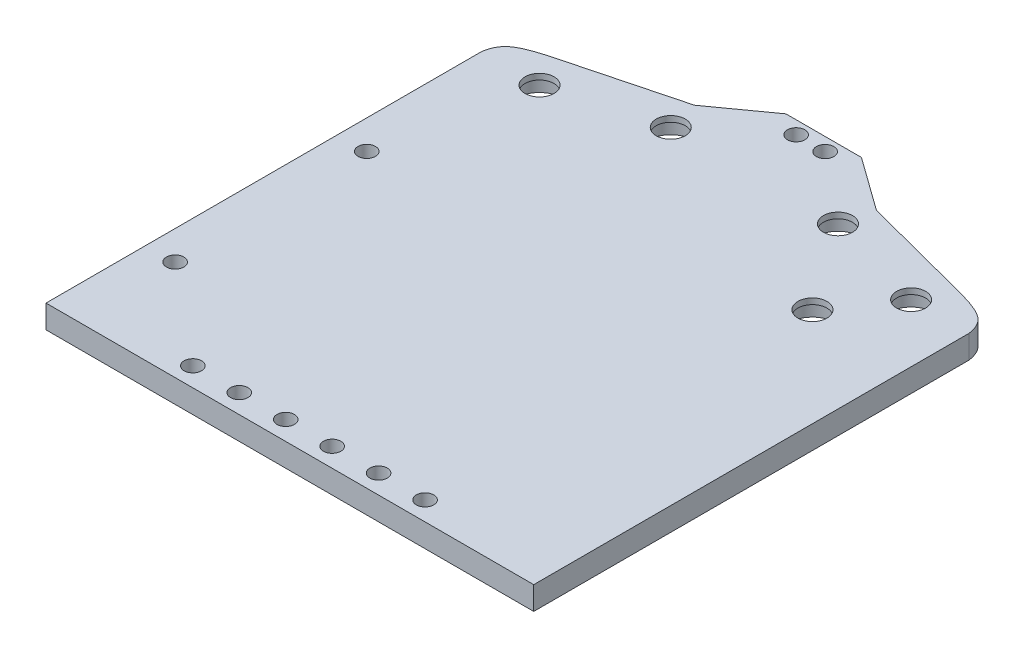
ISO-10303-21;
HEADER;
FILE_DESCRIPTION(('STEP AP214'),'2;1');
FILE_NAME('part.step','',(''),(''),'','','');
FILE_SCHEMA(('AUTOMOTIVE_DESIGN { 1 0 10303 214 1 1 1 1 }'));
ENDSEC;
DATA;
#1=APPLICATION_CONTEXT('core data for automotive mechanical design processes');
#2=APPLICATION_PROTOCOL_DEFINITION('international standard','automotive_design',2000,#1);
#3=PRODUCT_CONTEXT('',#1,'mechanical');
#4=PRODUCT('Part','Part','',(#3));
#5=PRODUCT_RELATED_PRODUCT_CATEGORY('part','',(#4));
#6=PRODUCT_DEFINITION_FORMATION('','',#4);
#7=PRODUCT_DEFINITION_CONTEXT('part definition',#1,'design');
#8=PRODUCT_DEFINITION('design','',#6,#7);
#9=PRODUCT_DEFINITION_SHAPE('','',#8);
#10=(LENGTH_UNIT() NAMED_UNIT(*) SI_UNIT(.MILLI.,.METRE.));
#11=(NAMED_UNIT(*) PLANE_ANGLE_UNIT() SI_UNIT($,.RADIAN.));
#12=(NAMED_UNIT(*) SI_UNIT($,.STERADIAN.) SOLID_ANGLE_UNIT());
#13=UNCERTAINTY_MEASURE_WITH_UNIT(LENGTH_MEASURE(1.E-05),#10,'distance_accuracy_value','');
#14=(GEOMETRIC_REPRESENTATION_CONTEXT(3) GLOBAL_UNCERTAINTY_ASSIGNED_CONTEXT((#13)) GLOBAL_UNIT_ASSIGNED_CONTEXT((#10,
#11,#12)) REPRESENTATION_CONTEXT('',''));
#15=CARTESIAN_POINT('',(0.,0.,0.));
#16=DIRECTION('',(0.,0.,1.));
#17=DIRECTION('',(1.,0.,0.));
#18=AXIS2_PLACEMENT_3D('',#15,#16,#17);
#19=CARTESIAN_POINT('',(0.,0.,0.));
#20=DIRECTION('',(0.,1.,0.));
#21=DIRECTION('',(0.,0.,1.));
#22=AXIS2_PLACEMENT_3D('',#19,#20,#21);
#23=PLANE('',#22);
#24=CARTESIAN_POINT('',(20.,0.,76.7166500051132));
#25=DIRECTION('',(0.,1.,0.));
#26=DIRECTION('',(0.,0.,1.));
#27=AXIS2_PLACEMENT_3D('',#24,#25,#26);
#28=CIRCLE('',#27,1.5);
#29=CARTESIAN_POINT('',(20.,0.,78.2166500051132));
#30=VERTEX_POINT('',#29);
#31=EDGE_CURVE('E348',#30,#30,#28,.T.);
#32=ORIENTED_EDGE('',*,*,#31,.T.);
#33=EDGE_LOOP('',(#32));
#34=FACE_BOUND('',#33,.T.);
#35=CARTESIAN_POINT('',(4.,0.,76.7166500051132));
#36=DIRECTION('',(0.,-1.,0.));
#37=DIRECTION('',(0.,0.,-1.));
#38=AXIS2_PLACEMENT_3D('',#35,#36,#37);
#39=CIRCLE('',#38,1.5);
#40=CARTESIAN_POINT('',(4.,0.,75.2166500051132));
#41=VERTEX_POINT('',#40);
#42=EDGE_CURVE('E364',#41,#41,#39,.F.);
#43=ORIENTED_EDGE('',*,*,#42,.T.);
#44=EDGE_LOOP('',(#43));
#45=FACE_BOUND('',#44,.T.);
#46=CARTESIAN_POINT('',(12.,0.,76.7166500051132));
#47=DIRECTION('',(0.,1.,0.));
#48=DIRECTION('',(0.,0.,1.));
#49=AXIS2_PLACEMENT_3D('',#46,#47,#48);
#50=CIRCLE('',#49,1.5);
#51=CARTESIAN_POINT('',(12.,0.,78.2166500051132));
#52=VERTEX_POINT('',#51);
#53=EDGE_CURVE('E361',#52,#52,#50,.T.);
#54=ORIENTED_EDGE('',*,*,#53,.T.);
#55=EDGE_LOOP('',(#54));
#56=FACE_BOUND('',#55,.T.);
#57=CARTESIAN_POINT('',(-2.5,0.,-9.69032986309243));
#58=DIRECTION('',(0.,1.,0.));
#59=DIRECTION('',(0.,0.,1.));
#60=AXIS2_PLACEMENT_3D('',#57,#58,#59);
#61=CIRCLE('',#60,1.50083412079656);
#62=CARTESIAN_POINT('',(-2.5,0.,-8.18949574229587));
#63=VERTEX_POINT('',#62);
#64=EDGE_CURVE('E373',#63,#63,#61,.T.);
#65=ORIENTED_EDGE('',*,*,#64,.T.);
#66=EDGE_LOOP('',(#65));
#67=FACE_BOUND('',#66,.T.);
#68=CARTESIAN_POINT('',(2.5,0.,-9.69032986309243));
#69=DIRECTION('',(0.,1.,0.));
#70=DIRECTION('',(0.,0.,1.));
#71=AXIS2_PLACEMENT_3D('',#68,#69,#70);
#72=CIRCLE('',#71,1.50083412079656);
#73=CARTESIAN_POINT('',(2.5,0.,-8.18949574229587));
#74=VERTEX_POINT('',#73);
#75=EDGE_CURVE('E380',#74,#74,#72,.F.);
#76=ORIENTED_EDGE('',*,*,#75,.F.);
#77=EDGE_LOOP('',(#76));
#78=FACE_BOUND('',#77,.T.);
#79=CARTESIAN_POINT('',(-32.,0.,5.));
#80=DIRECTION('',(0.,1.,0.));
#81=DIRECTION('',(0.,0.,1.));
#82=AXIS2_PLACEMENT_3D('',#79,#80,#81);
#83=CIRCLE('',#82,4.1);
#84=CARTESIAN_POINT('',(-32.,0.,9.1));
#85=VERTEX_POINT('',#84);
#86=EDGE_CURVE('E400',#85,#85,#83,.T.);
#87=ORIENTED_EDGE('',*,*,#86,.T.);
#88=EDGE_LOOP('',(#87));
#89=FACE_BOUND('',#88,.T.);
#90=CARTESIAN_POINT('',(25.,0.,15.));
#91=DIRECTION('',(0.,1.,0.));
#92=DIRECTION('',(0.,0.,1.));
#93=AXIS2_PLACEMENT_3D('',#90,#91,#92);
#94=CIRCLE('',#93,4.1);
#95=CARTESIAN_POINT('',(25.,0.,19.1));
#96=VERTEX_POINT('',#95);
#97=EDGE_CURVE('E408',#96,#96,#94,.T.);
#98=ORIENTED_EDGE('',*,*,#97,.T.);
#99=EDGE_LOOP('',(#98));
#100=FACE_BOUND('',#99,.T.);
#101=CARTESIAN_POINT('',(14.4,0.,0.));
#102=DIRECTION('',(0.,-1.,0.));
#103=DIRECTION('',(0.,0.,-1.));
#104=AXIS2_PLACEMENT_3D('',#101,#102,#103);
#105=CIRCLE('',#104,4.1);
#106=CARTESIAN_POINT('',(14.4,0.,-4.1));
#107=VERTEX_POINT('',#106);
#108=EDGE_CURVE('E393',#107,#107,#105,.T.);
#109=ORIENTED_EDGE('',*,*,#108,.F.);
#110=EDGE_LOOP('',(#109));
#111=FACE_BOUND('',#110,.T.);
#112=CARTESIAN_POINT('',(-14.4,0.,0.));
#113=DIRECTION('',(0.,1.,0.));
#114=DIRECTION('',(0.,0.,1.));
#115=AXIS2_PLACEMENT_3D('',#112,#113,#114);
#116=CIRCLE('',#115,4.1);
#117=CARTESIAN_POINT('',(-14.4,0.,4.1));
#118=VERTEX_POINT('',#117);
#119=EDGE_CURVE('E403',#118,#118,#116,.T.);
#120=ORIENTED_EDGE('',*,*,#119,.T.);
#121=EDGE_LOOP('',(#120));
#122=FACE_BOUND('',#121,.T.);
#123=DIRECTION('',(-0.811997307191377,0.,-0.583661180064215));
#124=VECTOR('',#123,1.);
#125=CARTESIAN_POINT('',(7.87375522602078,0.,-10.9540744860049));
#126=LINE('',#125,#124);
#127=CARTESIAN_POINT('',(15.6674949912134,0.,-5.35195818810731));
#128=VERTEX_POINT('',#127);
#129=CARTESIAN_POINT('',(6.50166344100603,0.,-11.9403298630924));
#130=VERTEX_POINT('',#129);
#131=EDGE_CURVE('E298',#128,#130,#126,.T.);
#132=ORIENTED_EDGE('',*,*,#131,.F.);
#133=CARTESIAN_POINT('',(14.4,0.,0.));
#134=DIRECTION('',(0.,1.,0.));
#135=DIRECTION('',(0.,0.,1.));
#136=AXIS2_PLACEMENT_3D('',#133,#134,#135);
#137=CIRCLE('',#136,5.5);
#138=CARTESIAN_POINT('',(15.9139132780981,0.,-5.28753880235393));
#139=VERTEX_POINT('',#138);
#140=EDGE_CURVE('E296',#128,#139,#137,.F.);
#141=ORIENTED_EDGE('',*,*,#140,.T.);
#142=DIRECTION('',(-0.967486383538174,0.,-0.252923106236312));
#143=VECTOR('',#142,1.);
#144=CARTESIAN_POINT('',(2.31187354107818,0.,-8.84342361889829));
#145=LINE('',#144,#143);
#146=CARTESIAN_POINT('',(32.,0.,-1.0822671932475));
#147=VERTEX_POINT('',#146);
#148=EDGE_CURVE('E231',#147,#139,#145,.T.);
#149=ORIENTED_EDGE('',*,*,#148,.F.);
#150=CARTESIAN_POINT('',(32.,0.,-1.0822671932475));
#151=CARTESIAN_POINT('',(34.479638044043,0.,-0.458520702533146));
#152=CARTESIAN_POINT('',(39.7445832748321,0.,0.833673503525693));
#153=CARTESIAN_POINT('',(41.6503652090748,0.,2.84167312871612));
#154=CARTESIAN_POINT('',(42.,0.,4.99999999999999));
#155=B_SPLINE_CURVE_WITH_KNOTS('',3,(#150,#151,#152,#153,#154),.UNSPECIFIED.,.F.,.F.,(4,1,4),
(0.,0.499397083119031,1.),.UNSPECIFIED.);
#156=CARTESIAN_POINT('',(42.,0.,4.99999999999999));
#157=VERTEX_POINT('',#156);
#158=EDGE_CURVE('E287',#147,#157,#155,.T.);
#159=ORIENTED_EDGE('',*,*,#158,.T.);
#160=DIRECTION('',(0.,0.,1.));
#161=VECTOR('',#160,1.);
#162=CARTESIAN_POINT('',(42.,0.,0.));
#163=LINE('',#162,#161);
#164=CARTESIAN_POINT('',(42.,0.,80.));
#165=VERTEX_POINT('',#164);
#166=EDGE_CURVE('E284',#157,#165,#163,.T.);
#167=ORIENTED_EDGE('',*,*,#166,.T.);
#168=DIRECTION('',(1.,0.,0.));
#169=VECTOR('',#168,1.);
#170=CARTESIAN_POINT('',(0.,0.,80.));
#171=LINE('',#170,#169);
#172=CARTESIAN_POINT('',(-42.,0.,80.));
#173=VERTEX_POINT('',#172);
#174=EDGE_CURVE('E281',#173,#165,#171,.T.);
#175=ORIENTED_EDGE('',*,*,#174,.F.);
#176=DIRECTION('',(0.,0.,1.));
#177=VECTOR('',#176,1.);
#178=CARTESIAN_POINT('',(-42.,0.,0.));
#179=LINE('',#178,#177);
#180=CARTESIAN_POINT('',(-42.,0.,5.));
#181=VERTEX_POINT('',#180);
#182=EDGE_CURVE('E276',#181,#173,#179,.T.);
#183=ORIENTED_EDGE('',*,*,#182,.F.);
#184=CARTESIAN_POINT('',(-32.,0.,-1.08226719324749));
#185=CARTESIAN_POINT('',(-34.479638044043,0.,-0.458520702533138));
#186=CARTESIAN_POINT('',(-39.7445832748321,0.,0.833673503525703));
#187=CARTESIAN_POINT('',(-41.6503652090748,0.,2.84167312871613));
#188=CARTESIAN_POINT('',(-42.,0.,5.));
#189=B_SPLINE_CURVE_WITH_KNOTS('',3,(#184,#185,#186,#187,#188),.UNSPECIFIED.,.F.,.F.,(4,1,4),
(0.,0.499397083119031,1.),.UNSPECIFIED.);
#190=CARTESIAN_POINT('',(-32.,0.,-1.08226719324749));
#191=VERTEX_POINT('',#190);
#192=EDGE_CURVE('E272',#191,#181,#189,.T.);
#193=ORIENTED_EDGE('',*,*,#192,.F.);
#194=DIRECTION('',(0.967486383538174,0.,-0.252923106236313));
#195=VECTOR('',#194,1.);
#196=CARTESIAN_POINT('',(-2.31187354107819,0.,-8.8434236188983));
#197=LINE('',#196,#195);
#198=CARTESIAN_POINT('',(-15.6674949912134,0.,-5.35195818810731));
#199=VERTEX_POINT('',#198);
#200=EDGE_CURVE('E269',#191,#199,#197,.T.);
#201=ORIENTED_EDGE('',*,*,#200,.T.);
#202=DIRECTION('',(0.811997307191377,0.,-0.583661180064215));
#203=VECTOR('',#202,1.);
#204=CARTESIAN_POINT('',(-7.87375522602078,0.,-10.9540744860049));
#205=LINE('',#204,#203);
#206=CARTESIAN_POINT('',(-6.50166344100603,0.,-11.9403298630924));
#207=VERTEX_POINT('',#206);
#208=EDGE_CURVE('E265',#199,#207,#205,.T.);
#209=ORIENTED_EDGE('',*,*,#208,.T.);
#210=DIRECTION('',(1.,0.,0.));
#211=VECTOR('',#210,1.);
#212=CARTESIAN_POINT('',(0.,0.,-11.9403298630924));
#213=LINE('',#212,#211);
#214=EDGE_CURVE('E262',#207,#130,#213,.T.);
#215=ORIENTED_EDGE('',*,*,#214,.T.);
#216=EDGE_LOOP('',(#132,#141,#149,#159,#167,#175,#183,#193,#201,#209,#215));
#217=FACE_BOUND('',#216,.T.);
#218=CARTESIAN_POINT('',(32.,0.,5.));
#219=DIRECTION('',(0.,1.,0.));
#220=DIRECTION('',(0.,0.,1.));
#221=AXIS2_PLACEMENT_3D('',#218,#219,#220);
#222=CIRCLE('',#221,4.1);
#223=CARTESIAN_POINT('',(32.,0.,9.1));
#224=VERTEX_POINT('',#223);
#225=EDGE_CURVE('E385',#224,#224,#222,.F.);
#226=ORIENTED_EDGE('',*,*,#225,.F.);
#227=EDGE_LOOP('',(#226));
#228=FACE_BOUND('',#227,.T.);
#229=CARTESIAN_POINT('',(-4.,0.,76.7166500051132));
#230=DIRECTION('',(0.,-1.,0.));
#231=DIRECTION('',(0.,0.,-1.));
#232=AXIS2_PLACEMENT_3D('',#229,#230,#231);
#233=CIRCLE('',#232,1.5);
#234=CARTESIAN_POINT('',(-4.,0.,75.2166500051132));
#235=VERTEX_POINT('',#234);
#236=EDGE_CURVE('E327',#235,#235,#233,.T.);
#237=ORIENTED_EDGE('',*,*,#236,.F.);
#238=EDGE_LOOP('',(#237));
#239=FACE_BOUND('',#238,.T.);
#240=CARTESIAN_POINT('',(-12.,0.,76.7166500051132));
#241=DIRECTION('',(0.,-1.,0.));
#242=DIRECTION('',(0.,0.,-1.));
#243=AXIS2_PLACEMENT_3D('',#240,#241,#242);
#244=CIRCLE('',#243,1.5);
#245=CARTESIAN_POINT('',(-12.,0.,75.2166500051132));
#246=VERTEX_POINT('',#245);
#247=EDGE_CURVE('E357',#246,#246,#244,.T.);
#248=ORIENTED_EDGE('',*,*,#247,.F.);
#249=EDGE_LOOP('',(#248));
#250=FACE_BOUND('',#249,.T.);
#251=CARTESIAN_POINT('',(-20.,0.,76.7166500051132));
#252=DIRECTION('',(0.,-1.,0.));
#253=DIRECTION('',(0.,0.,-1.));
#254=AXIS2_PLACEMENT_3D('',#251,#252,#253);
#255=CIRCLE('',#254,1.5);
#256=CARTESIAN_POINT('',(-20.,0.,75.2166500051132));
#257=VERTEX_POINT('',#256);
#258=EDGE_CURVE('E360',#257,#257,#255,.T.);
#259=ORIENTED_EDGE('',*,*,#258,.F.);
#260=EDGE_LOOP('',(#259));
#261=FACE_BOUND('',#260,.T.);
#262=CARTESIAN_POINT('',(-37.0000000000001,0.,29.7600000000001));
#263=DIRECTION('',(0.,-1.,0.));
#264=DIRECTION('',(0.,0.,-1.));
#265=AXIS2_PLACEMENT_3D('',#262,#263,#264);
#266=CIRCLE('',#265,1.50000000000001);
#267=CARTESIAN_POINT('',(-37.0000000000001,0.,28.2600000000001));
#268=VERTEX_POINT('',#267);
#269=EDGE_CURVE('E350',#268,#268,#266,.F.);
#270=ORIENTED_EDGE('',*,*,#269,.T.);
#271=EDGE_LOOP('',(#270));
#272=FACE_BOUND('',#271,.T.);
#273=CARTESIAN_POINT('',(-37.,0.,62.76));
#274=DIRECTION('',(0.,-1.,0.));
#275=DIRECTION('',(0.,0.,-1.));
#276=AXIS2_PLACEMENT_3D('',#273,#274,#275);
#277=CIRCLE('',#276,1.5);
#278=CARTESIAN_POINT('',(-37.,0.,61.26));
#279=VERTEX_POINT('',#278);
#280=EDGE_CURVE('E344',#279,#279,#277,.T.);
#281=ORIENTED_EDGE('',*,*,#280,.F.);
#282=EDGE_LOOP('',(#281));
#283=FACE_BOUND('',#282,.T.);
#284=ADVANCED_FACE('F135',(#34,#45,#56,#67,#78,#89,#100,#111,#122,#217,#228,#239,#250,#261,#272,
#283),#23,.F.);
#285=CARTESIAN_POINT('',(0.,4.,0.));
#286=DIRECTION('',(0.,1.,0.));
#287=DIRECTION('',(0.,0.,1.));
#288=AXIS2_PLACEMENT_3D('',#285,#286,#287);
#289=PLANE('',#288);
#290=CARTESIAN_POINT('',(-37.0000000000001,4.,29.7600000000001));
#291=DIRECTION('',(0.,1.,0.));
#292=DIRECTION('',(0.,0.,1.));
#293=AXIS2_PLACEMENT_3D('',#290,#291,#292);
#294=CIRCLE('',#293,1.50000000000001);
#295=CARTESIAN_POINT('',(-37.0000000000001,4.,31.2600000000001));
#296=VERTEX_POINT('',#295);
#297=EDGE_CURVE('E342',#296,#296,#294,.F.);
#298=ORIENTED_EDGE('',*,*,#297,.T.);
#299=EDGE_LOOP('',(#298));
#300=FACE_BOUND('',#299,.T.);
#301=CARTESIAN_POINT('',(4.,4.,76.7166500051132));
#302=DIRECTION('',(0.,1.,0.));
#303=DIRECTION('',(0.,0.,1.));
#304=AXIS2_PLACEMENT_3D('',#301,#302,#303);
#305=CIRCLE('',#304,1.5);
#306=CARTESIAN_POINT('',(4.,4.,78.2166500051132));
#307=VERTEX_POINT('',#306);
#308=EDGE_CURVE('E336',#307,#307,#305,.F.);
#309=ORIENTED_EDGE('',*,*,#308,.T.);
#310=EDGE_LOOP('',(#309));
#311=FACE_BOUND('',#310,.T.);
#312=CARTESIAN_POINT('',(-20.,4.,76.7166500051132));
#313=DIRECTION('',(0.,1.,0.));
#314=DIRECTION('',(0.,0.,1.));
#315=AXIS2_PLACEMENT_3D('',#312,#313,#314);
#316=CIRCLE('',#315,1.5);
#317=CARTESIAN_POINT('',(-20.,4.,78.2166500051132));
#318=VERTEX_POINT('',#317);
#319=EDGE_CURVE('E333',#318,#318,#316,.T.);
#320=ORIENTED_EDGE('',*,*,#319,.F.);
#321=EDGE_LOOP('',(#320));
#322=FACE_BOUND('',#321,.T.);
#323=CARTESIAN_POINT('',(-12.,4.,76.7166500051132));
#324=DIRECTION('',(0.,1.,0.));
#325=DIRECTION('',(0.,0.,1.));
#326=AXIS2_PLACEMENT_3D('',#323,#324,#325);
#327=CIRCLE('',#326,1.5);
#328=CARTESIAN_POINT('',(-12.,4.,78.2166500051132));
#329=VERTEX_POINT('',#328);
#330=EDGE_CURVE('E330',#329,#329,#327,.T.);
#331=ORIENTED_EDGE('',*,*,#330,.F.);
#332=EDGE_LOOP('',(#331));
#333=FACE_BOUND('',#332,.T.);
#334=CARTESIAN_POINT('',(-2.5,4.,-9.69032986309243));
#335=DIRECTION('',(0.,1.,0.));
#336=DIRECTION('',(0.,0.,1.));
#337=AXIS2_PLACEMENT_3D('',#334,#335,#336);
#338=CIRCLE('',#337,1.50083412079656);
#339=CARTESIAN_POINT('',(-2.5,4.,-8.18949574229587));
#340=VERTEX_POINT('',#339);
#341=EDGE_CURVE('E377',#340,#340,#338,.T.);
#342=ORIENTED_EDGE('',*,*,#341,.F.);
#343=EDGE_LOOP('',(#342));
#344=FACE_BOUND('',#343,.T.);
#345=CARTESIAN_POINT('',(14.4,4.,0.));
#346=DIRECTION('',(0.,-1.,0.));
#347=DIRECTION('',(0.,0.,-1.));
#348=AXIS2_PLACEMENT_3D('',#345,#346,#347);
#349=CIRCLE('',#348,2.5);
#350=CARTESIAN_POINT('',(14.4,4.,-2.5));
#351=VERTEX_POINT('',#350);
#352=EDGE_CURVE('E266',#351,#351,#349,.T.);
#353=ORIENTED_EDGE('',*,*,#352,.T.);
#354=EDGE_LOOP('',(#353));
#355=FACE_BOUND('',#354,.T.);
#356=CARTESIAN_POINT('',(-14.4,4.,0.));
#357=DIRECTION('',(0.,1.,0.));
#358=DIRECTION('',(0.,0.,1.));
#359=AXIS2_PLACEMENT_3D('',#356,#357,#358);
#360=CIRCLE('',#359,2.5);
#361=CARTESIAN_POINT('',(-14.4,4.,2.5));
#362=VERTEX_POINT('',#361);
#363=EDGE_CURVE('E259',#362,#362,#360,.T.);
#364=ORIENTED_EDGE('',*,*,#363,.F.);
#365=EDGE_LOOP('',(#364));
#366=FACE_BOUND('',#365,.T.);
#367=CARTESIAN_POINT('',(25.,4.,15.));
#368=DIRECTION('',(0.,1.,0.));
#369=DIRECTION('',(0.,0.,1.));
#370=AXIS2_PLACEMENT_3D('',#367,#368,#369);
#371=CIRCLE('',#370,2.5);
#372=CARTESIAN_POINT('',(25.,4.,17.5));
#373=VERTEX_POINT('',#372);
#374=EDGE_CURVE('E256',#373,#373,#371,.T.);
#375=ORIENTED_EDGE('',*,*,#374,.F.);
#376=EDGE_LOOP('',(#375));
#377=FACE_BOUND('',#376,.T.);
#378=CARTESIAN_POINT('',(-32.,4.,5.));
#379=DIRECTION('',(0.,1.,0.));
#380=DIRECTION('',(0.,0.,1.));
#381=AXIS2_PLACEMENT_3D('',#378,#379,#380);
#382=CIRCLE('',#381,2.5);
#383=CARTESIAN_POINT('',(-32.,4.,7.5));
#384=VERTEX_POINT('',#383);
#385=EDGE_CURVE('E253',#384,#384,#382,.T.);
#386=ORIENTED_EDGE('',*,*,#385,.F.);
#387=EDGE_LOOP('',(#386));
#388=FACE_BOUND('',#387,.T.);
#389=CARTESIAN_POINT('',(32.,4.,5.));
#390=DIRECTION('',(0.,1.,0.));
#391=DIRECTION('',(0.,0.,1.));
#392=AXIS2_PLACEMENT_3D('',#389,#390,#391);
#393=CIRCLE('',#392,2.5);
#394=CARTESIAN_POINT('',(32.,4.,7.5));
#395=VERTEX_POINT('',#394);
#396=EDGE_CURVE('E247',#395,#395,#393,.F.);
#397=ORIENTED_EDGE('',*,*,#396,.T.);
#398=EDGE_LOOP('',(#397));
#399=FACE_BOUND('',#398,.T.);
#400=DIRECTION('',(-0.967486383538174,0.,-0.252923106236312));
#401=VECTOR('',#400,1.);
#402=CARTESIAN_POINT('',(2.31187354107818,4.,-8.84342361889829));
#403=LINE('',#402,#401);
#404=CARTESIAN_POINT('',(32.,4.,-1.0822671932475));
#405=VERTEX_POINT('',#404);
#406=CARTESIAN_POINT('',(15.9139132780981,4.,-5.28753880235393));
#407=VERTEX_POINT('',#406);
#408=EDGE_CURVE('E228',#405,#407,#403,.T.);
#409=ORIENTED_EDGE('',*,*,#408,.T.);
#410=CARTESIAN_POINT('',(14.4,4.,0.));
#411=DIRECTION('',(0.,1.,0.));
#412=DIRECTION('',(0.,0.,1.));
#413=AXIS2_PLACEMENT_3D('',#410,#411,#412);
#414=CIRCLE('',#413,5.5);
#415=CARTESIAN_POINT('',(15.6674949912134,4.,-5.35195818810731));
#416=VERTEX_POINT('',#415);
#417=EDGE_CURVE('E240',#416,#407,#414,.F.);
#418=ORIENTED_EDGE('',*,*,#417,.F.);
#419=DIRECTION('',(-0.811997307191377,0.,-0.583661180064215));
#420=VECTOR('',#419,1.);
#421=CARTESIAN_POINT('',(7.87375522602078,4.,-10.9540744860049));
#422=LINE('',#421,#420);
#423=CARTESIAN_POINT('',(6.50166344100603,4.,-11.9403298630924));
#424=VERTEX_POINT('',#423);
#425=EDGE_CURVE('E154',#416,#424,#422,.T.);
#426=ORIENTED_EDGE('',*,*,#425,.T.);
#427=DIRECTION('',(1.,0.,0.));
#428=VECTOR('',#427,1.);
#429=CARTESIAN_POINT('',(0.,4.,-11.9403298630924));
#430=LINE('',#429,#428);
#431=CARTESIAN_POINT('',(-6.50166344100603,4.,-11.9403298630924));
#432=VERTEX_POINT('',#431);
#433=EDGE_CURVE('E300',#432,#424,#430,.T.);
#434=ORIENTED_EDGE('',*,*,#433,.F.);
#435=DIRECTION('',(0.811997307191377,0.,-0.583661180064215));
#436=VECTOR('',#435,1.);
#437=CARTESIAN_POINT('',(-7.87375522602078,4.,-10.9540744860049));
#438=LINE('',#437,#436);
#439=CARTESIAN_POINT('',(-15.6674949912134,4.,-5.35195818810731));
#440=VERTEX_POINT('',#439);
#441=EDGE_CURVE('E426',#440,#432,#438,.T.);
#442=ORIENTED_EDGE('',*,*,#441,.F.);
#443=DIRECTION('',(0.967486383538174,0.,-0.252923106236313));
#444=VECTOR('',#443,1.);
#445=CARTESIAN_POINT('',(-2.31187354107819,4.,-8.8434236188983));
#446=LINE('',#445,#444);
#447=CARTESIAN_POINT('',(-32.,4.,-1.08226719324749));
#448=VERTEX_POINT('',#447);
#449=EDGE_CURVE('E429',#448,#440,#446,.T.);
#450=ORIENTED_EDGE('',*,*,#449,.F.);
#451=CARTESIAN_POINT('',(-32.,4.,-1.08226719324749));
#452=CARTESIAN_POINT('',(-34.479638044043,4.,-0.458520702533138));
#453=CARTESIAN_POINT('',(-39.7445832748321,4.,0.833673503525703));
#454=CARTESIAN_POINT('',(-41.6503652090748,4.,2.84167312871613));
#455=CARTESIAN_POINT('',(-42.,4.,5.));
#456=B_SPLINE_CURVE_WITH_KNOTS('',3,(#451,#452,#453,#454,#455),.UNSPECIFIED.,.F.,.F.,(4,1,4),
(0.,0.499397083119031,1.),.UNSPECIFIED.);
#457=CARTESIAN_POINT('',(-42.,4.,5.));
#458=VERTEX_POINT('',#457);
#459=EDGE_CURVE('E432',#448,#458,#456,.T.);
#460=ORIENTED_EDGE('',*,*,#459,.T.);
#461=DIRECTION('',(0.,0.,1.));
#462=VECTOR('',#461,1.);
#463=CARTESIAN_POINT('',(-42.,4.,0.));
#464=LINE('',#463,#462);
#465=CARTESIAN_POINT('',(-42.,4.,80.));
#466=VERTEX_POINT('',#465);
#467=EDGE_CURVE('E437',#458,#466,#464,.T.);
#468=ORIENTED_EDGE('',*,*,#467,.T.);
#469=DIRECTION('',(1.,0.,0.));
#470=VECTOR('',#469,1.);
#471=CARTESIAN_POINT('',(0.,4.,80.));
#472=LINE('',#471,#470);
#473=CARTESIAN_POINT('',(42.,4.,80.));
#474=VERTEX_POINT('',#473);
#475=EDGE_CURVE('E509',#466,#474,#472,.T.);
#476=ORIENTED_EDGE('',*,*,#475,.T.);
#477=DIRECTION('',(0.,0.,1.));
#478=VECTOR('',#477,1.);
#479=CARTESIAN_POINT('',(42.,4.,0.));
#480=LINE('',#479,#478);
#481=CARTESIAN_POINT('',(42.,4.,4.99999999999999));
#482=VERTEX_POINT('',#481);
#483=EDGE_CURVE('E504',#482,#474,#480,.T.);
#484=ORIENTED_EDGE('',*,*,#483,.F.);
#485=CARTESIAN_POINT('',(32.,4.,-1.0822671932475));
#486=CARTESIAN_POINT('',(34.479638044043,4.,-0.458520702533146));
#487=CARTESIAN_POINT('',(39.7445832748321,4.,0.833673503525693));
#488=CARTESIAN_POINT('',(41.6503652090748,4.,2.84167312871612));
#489=CARTESIAN_POINT('',(42.,4.,4.99999999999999));
#490=B_SPLINE_CURVE_WITH_KNOTS('',3,(#485,#486,#487,#488,#489),.UNSPECIFIED.,.F.,.F.,(4,1,4),
(0.,0.499397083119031,1.),.UNSPECIFIED.);
#491=EDGE_CURVE('E243',#405,#482,#490,.T.);
#492=ORIENTED_EDGE('',*,*,#491,.F.);
#493=EDGE_LOOP('',(#409,#418,#426,#434,#442,#450,#460,#468,#476,#484,#492));
#494=FACE_BOUND('',#493,.T.);
#495=CARTESIAN_POINT('',(2.5,4.,-9.69032986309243));
#496=DIRECTION('',(0.,1.,0.));
#497=DIRECTION('',(0.,0.,1.));
#498=AXIS2_PLACEMENT_3D('',#495,#496,#497);
#499=CIRCLE('',#498,1.50083412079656);
#500=CARTESIAN_POINT('',(2.5,4.,-8.18949574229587));
#501=VERTEX_POINT('',#500);
#502=EDGE_CURVE('E341',#501,#501,#499,.F.);
#503=ORIENTED_EDGE('',*,*,#502,.T.);
#504=EDGE_LOOP('',(#503));
#505=FACE_BOUND('',#504,.T.);
#506=CARTESIAN_POINT('',(-4.,4.,76.7166500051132));
#507=DIRECTION('',(0.,1.,0.));
#508=DIRECTION('',(0.,0.,1.));
#509=AXIS2_PLACEMENT_3D('',#506,#507,#508);
#510=CIRCLE('',#509,1.5);
#511=CARTESIAN_POINT('',(-4.,4.,78.2166500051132));
#512=VERTEX_POINT('',#511);
#513=EDGE_CURVE('E323',#512,#512,#510,.T.);
#514=ORIENTED_EDGE('',*,*,#513,.F.);
#515=EDGE_LOOP('',(#514));
#516=FACE_BOUND('',#515,.T.);
#517=CARTESIAN_POINT('',(12.,4.,76.7166500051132));
#518=DIRECTION('',(0.,1.,0.));
#519=DIRECTION('',(0.,0.,1.));
#520=AXIS2_PLACEMENT_3D('',#517,#518,#519);
#521=CIRCLE('',#520,1.5);
#522=CARTESIAN_POINT('',(12.,4.,78.2166500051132));
#523=VERTEX_POINT('',#522);
#524=EDGE_CURVE('E326',#523,#523,#521,.F.);
#525=ORIENTED_EDGE('',*,*,#524,.T.);
#526=EDGE_LOOP('',(#525));
#527=FACE_BOUND('',#526,.T.);
#528=CARTESIAN_POINT('',(20.,4.,76.7166500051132));
#529=DIRECTION('',(0.,1.,0.));
#530=DIRECTION('',(0.,0.,1.));
#531=AXIS2_PLACEMENT_3D('',#528,#529,#530);
#532=CIRCLE('',#531,1.5);
#533=CARTESIAN_POINT('',(20.,4.,78.2166500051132));
#534=VERTEX_POINT('',#533);
#535=EDGE_CURVE('E339',#534,#534,#532,.F.);
#536=ORIENTED_EDGE('',*,*,#535,.T.);
#537=EDGE_LOOP('',(#536));
#538=FACE_BOUND('',#537,.T.);
#539=CARTESIAN_POINT('',(-37.,4.,62.76));
#540=DIRECTION('',(0.,1.,0.));
#541=DIRECTION('',(0.,0.,1.));
#542=AXIS2_PLACEMENT_3D('',#539,#540,#541);
#543=CIRCLE('',#542,1.5);
#544=CARTESIAN_POINT('',(-37.,4.,64.26));
#545=VERTEX_POINT('',#544);
#546=EDGE_CURVE('E139',#545,#545,#543,.T.);
#547=ORIENTED_EDGE('',*,*,#546,.F.);
#548=EDGE_LOOP('',(#547));
#549=FACE_BOUND('',#548,.T.);
#550=ADVANCED_FACE('F238',(#300,#311,#322,#333,#344,#355,#366,#377,#388,#399,#494,#505,#516,
#527,#538,#549),#289,.T.);
#551=CARTESIAN_POINT('',(14.4,4.,0.));
#552=DIRECTION('',(0.,-1.,0.));
#553=DIRECTION('',(0.,0.,-1.));
#554=AXIS2_PLACEMENT_3D('',#551,#552,#553);
#555=CYLINDRICAL_SURFACE('',#554,2.5);
#556=ORIENTED_EDGE('',*,*,#352,.F.);
#557=EDGE_LOOP('',(#556));
#558=FACE_BOUND('',#557,.T.);
#559=CARTESIAN_POINT('',(14.4,3.,0.));
#560=DIRECTION('',(0.,-1.,0.));
#561=DIRECTION('',(0.,0.,-1.));
#562=AXIS2_PLACEMENT_3D('',#559,#560,#561);
#563=CIRCLE('',#562,2.5);
#564=CARTESIAN_POINT('',(14.4,3.,-2.5));
#565=VERTEX_POINT('',#564);
#566=EDGE_CURVE('E319',#565,#565,#563,.F.);
#567=ORIENTED_EDGE('',*,*,#566,.F.);
#568=EDGE_LOOP('',(#567));
#569=FACE_BOUND('',#568,.T.);
#570=ADVANCED_FACE('F137',(#558,#569),#555,.F.);
#571=CARTESIAN_POINT('',(14.4,4.,0.));
#572=DIRECTION('',(0.,-1.,0.));
#573=DIRECTION('',(0.,0.,-1.));
#574=AXIS2_PLACEMENT_3D('',#571,#572,#573);
#575=CYLINDRICAL_SURFACE('',#574,5.5);
#576=ORIENTED_EDGE('',*,*,#140,.F.);
#577=DIRECTION('',(0.,-1.,0.));
#578=VECTOR('',#577,1.);
#579=CARTESIAN_POINT('',(15.6674949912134,4.,-5.35195818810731));
#580=LINE('',#579,#578);
#581=EDGE_CURVE('E190',#416,#128,#580,.T.);
#582=ORIENTED_EDGE('',*,*,#581,.F.);
#583=ORIENTED_EDGE('',*,*,#417,.T.);
#584=DIRECTION('',(0.,-1.,0.));
#585=VECTOR('',#584,1.);
#586=CARTESIAN_POINT('',(15.9139132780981,4.,-5.28753880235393));
#587=LINE('',#586,#585);
#588=EDGE_CURVE('E225',#407,#139,#587,.T.);
#589=ORIENTED_EDGE('',*,*,#588,.T.);
#590=EDGE_LOOP('',(#576,#582,#583,#589));
#591=FACE_BOUND('',#590,.T.);
#592=ADVANCED_FACE('F245',(#591),#575,.T.);
#593=CARTESIAN_POINT('',(-14.4,4.,0.));
#594=DIRECTION('',(0.,-1.,0.));
#595=DIRECTION('',(0.,0.,-1.));
#596=AXIS2_PLACEMENT_3D('',#593,#594,#595);
#597=CYLINDRICAL_SURFACE('',#596,2.5);
#598=CARTESIAN_POINT('',(-14.4,3.,0.));
#599=DIRECTION('',(0.,1.,0.));
#600=DIRECTION('',(0.,0.,1.));
#601=AXIS2_PLACEMENT_3D('',#598,#599,#600);
#602=CIRCLE('',#601,2.5);
#603=CARTESIAN_POINT('',(-14.4,3.,2.5));
#604=VERTEX_POINT('',#603);
#605=EDGE_CURVE('E418',#604,#604,#602,.T.);
#606=ORIENTED_EDGE('',*,*,#605,.F.);
#607=EDGE_LOOP('',(#606));
#608=FACE_BOUND('',#607,.T.);
#609=ORIENTED_EDGE('',*,*,#363,.T.);
#610=EDGE_LOOP('',(#609));
#611=FACE_BOUND('',#610,.T.);
#612=ADVANCED_FACE('F476',(#608,#611),#597,.F.);
#613=CARTESIAN_POINT('',(25.,4.,15.));
#614=DIRECTION('',(0.,-1.,0.));
#615=DIRECTION('',(0.,0.,-1.));
#616=AXIS2_PLACEMENT_3D('',#613,#614,#615);
#617=CYLINDRICAL_SURFACE('',#616,2.5);
#618=CARTESIAN_POINT('',(25.,3.,15.));
#619=DIRECTION('',(0.,1.,0.));
#620=DIRECTION('',(0.,0.,1.));
#621=AXIS2_PLACEMENT_3D('',#618,#619,#620);
#622=CIRCLE('',#621,2.5);
#623=CARTESIAN_POINT('',(25.,3.,17.5));
#624=VERTEX_POINT('',#623);
#625=EDGE_CURVE('E388',#624,#624,#622,.T.);
#626=ORIENTED_EDGE('',*,*,#625,.F.);
#627=EDGE_LOOP('',(#626));
#628=FACE_BOUND('',#627,.T.);
#629=ORIENTED_EDGE('',*,*,#374,.T.);
#630=EDGE_LOOP('',(#629));
#631=FACE_BOUND('',#630,.T.);
#632=ADVANCED_FACE('F479',(#628,#631),#617,.F.);
#633=CARTESIAN_POINT('',(-32.,4.,5.));
#634=DIRECTION('',(0.,-1.,0.));
#635=DIRECTION('',(0.,0.,-1.));
#636=AXIS2_PLACEMENT_3D('',#633,#634,#635);
#637=CYLINDRICAL_SURFACE('',#636,2.5);
#638=CARTESIAN_POINT('',(-32.,3.,5.));
#639=DIRECTION('',(0.,1.,0.));
#640=DIRECTION('',(0.,0.,1.));
#641=AXIS2_PLACEMENT_3D('',#638,#639,#640);
#642=CIRCLE('',#641,2.5);
#643=CARTESIAN_POINT('',(-32.,3.,7.5));
#644=VERTEX_POINT('',#643);
#645=EDGE_CURVE('E404',#644,#644,#642,.T.);
#646=ORIENTED_EDGE('',*,*,#645,.F.);
#647=EDGE_LOOP('',(#646));
#648=FACE_BOUND('',#647,.T.);
#649=ORIENTED_EDGE('',*,*,#385,.T.);
#650=EDGE_LOOP('',(#649));
#651=FACE_BOUND('',#650,.T.);
#652=ADVANCED_FACE('F463',(#648,#651),#637,.F.);
#653=CARTESIAN_POINT('',(32.,4.,5.));
#654=DIRECTION('',(0.,-1.,0.));
#655=DIRECTION('',(0.,0.,-1.));
#656=AXIS2_PLACEMENT_3D('',#653,#654,#655);
#657=CYLINDRICAL_SURFACE('',#656,2.5);
#658=CARTESIAN_POINT('',(32.,3.,5.));
#659=DIRECTION('',(0.,1.,0.));
#660=DIRECTION('',(0.,0.,1.));
#661=AXIS2_PLACEMENT_3D('',#658,#659,#660);
#662=CIRCLE('',#661,2.5);
#663=CARTESIAN_POINT('',(32.,3.,7.5));
#664=VERTEX_POINT('',#663);
#665=EDGE_CURVE('E390',#664,#664,#662,.F.);
#666=ORIENTED_EDGE('',*,*,#665,.T.);
#667=EDGE_LOOP('',(#666));
#668=FACE_BOUND('',#667,.T.);
#669=ORIENTED_EDGE('',*,*,#396,.F.);
#670=EDGE_LOOP('',(#669));
#671=FACE_BOUND('',#670,.T.);
#672=ADVANCED_FACE('F459',(#668,#671),#657,.F.);
#673=CARTESIAN_POINT('',(0.,4.,-11.9403298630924));
#674=DIRECTION('',(0.,0.,-1.));
#675=DIRECTION('',(-1.,0.,0.));
#676=AXIS2_PLACEMENT_3D('',#673,#674,#675);
#677=PLANE('',#676);
#678=ORIENTED_EDGE('',*,*,#214,.F.);
#679=DIRECTION('',(0.,-1.,0.));
#680=VECTOR('',#679,1.);
#681=CARTESIAN_POINT('',(-6.50166344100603,4.,-11.9403298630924));
#682=LINE('',#681,#680);
#683=EDGE_CURVE('E12',#432,#207,#682,.T.);
#684=ORIENTED_EDGE('',*,*,#683,.F.);
#685=ORIENTED_EDGE('',*,*,#433,.T.);
#686=DIRECTION('',(0.,-1.,0.));
#687=VECTOR('',#686,1.);
#688=CARTESIAN_POINT('',(6.50166344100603,4.,-11.9403298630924));
#689=LINE('',#688,#687);
#690=EDGE_CURVE('E197',#424,#130,#689,.T.);
#691=ORIENTED_EDGE('',*,*,#690,.T.);
#692=EDGE_LOOP('',(#678,#684,#685,#691));
#693=FACE_BOUND('',#692,.T.);
#694=ADVANCED_FACE('F456',(#693),#677,.T.);
#695=CARTESIAN_POINT('',(-7.87375522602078,4.,-10.9540744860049));
#696=DIRECTION('',(-0.583661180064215,0.,-0.811997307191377));
#697=DIRECTION('',(-0.811997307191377,0.,0.583661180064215));
#698=AXIS2_PLACEMENT_3D('',#695,#696,#697);
#699=PLANE('',#698);
#700=ORIENTED_EDGE('',*,*,#208,.F.);
#701=DIRECTION('',(0.,-1.,0.));
#702=VECTOR('',#701,1.);
#703=CARTESIAN_POINT('',(-15.6674949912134,4.,-5.35195818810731));
#704=LINE('',#703,#702);
#705=EDGE_CURVE('E145',#440,#199,#704,.T.);
#706=ORIENTED_EDGE('',*,*,#705,.F.);
#707=ORIENTED_EDGE('',*,*,#441,.T.);
#708=ORIENTED_EDGE('',*,*,#683,.T.);
#709=EDGE_LOOP('',(#700,#706,#707,#708));
#710=FACE_BOUND('',#709,.T.);
#711=ADVANCED_FACE('F453',(#710),#699,.T.);
#712=CARTESIAN_POINT('',(-2.31187354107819,4.,-8.8434236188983));
#713=DIRECTION('',(-0.252923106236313,0.,-0.967486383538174));
#714=DIRECTION('',(-0.967486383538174,0.,0.252923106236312));
#715=AXIS2_PLACEMENT_3D('',#712,#713,#714);
#716=PLANE('',#715);
#717=ORIENTED_EDGE('',*,*,#200,.F.);
#718=DIRECTION('',(0.,-1.,0.));
#719=VECTOR('',#718,1.);
#720=CARTESIAN_POINT('',(-32.,4.,-1.08226719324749));
#721=LINE('',#720,#719);
#722=EDGE_CURVE('E314',#448,#191,#721,.T.);
#723=ORIENTED_EDGE('',*,*,#722,.F.);
#724=ORIENTED_EDGE('',*,*,#449,.T.);
#725=ORIENTED_EDGE('',*,*,#705,.T.);
#726=EDGE_LOOP('',(#717,#723,#724,#725));
#727=FACE_BOUND('',#726,.T.);
#728=ADVANCED_FACE('F448',(#727),#716,.T.);
#729=DIRECTION('',(0.,-1.,0.));
#730=VECTOR('',#729,1.);
#731=SURFACE_OF_LINEAR_EXTRUSION('',#456,#730);
#732=ORIENTED_EDGE('',*,*,#192,.T.);
#733=DIRECTION('',(0.,-1.,0.));
#734=VECTOR('',#733,1.);
#735=CARTESIAN_POINT('',(-42.,4.,5.));
#736=LINE('',#735,#734);
#737=EDGE_CURVE('E311',#458,#181,#736,.T.);
#738=ORIENTED_EDGE('',*,*,#737,.F.);
#739=ORIENTED_EDGE('',*,*,#459,.F.);
#740=ORIENTED_EDGE('',*,*,#722,.T.);
#741=EDGE_LOOP('',(#732,#738,#739,#740));
#742=FACE_BOUND('',#741,.T.);
#743=ADVANCED_FACE('F443',(#742),#731,.F.);
#744=CARTESIAN_POINT('',(-42.,4.,0.));
#745=DIRECTION('',(1.,0.,0.));
#746=DIRECTION('',(0.,0.,-1.));
#747=AXIS2_PLACEMENT_3D('',#744,#745,#746);
#748=PLANE('',#747);
#749=ORIENTED_EDGE('',*,*,#182,.T.);
#750=DIRECTION('',(0.,-1.,0.));
#751=VECTOR('',#750,1.);
#752=CARTESIAN_POINT('',(-42.,4.,80.));
#753=LINE('',#752,#751);
#754=EDGE_CURVE('E308',#466,#173,#753,.T.);
#755=ORIENTED_EDGE('',*,*,#754,.F.);
#756=ORIENTED_EDGE('',*,*,#467,.F.);
#757=ORIENTED_EDGE('',*,*,#737,.T.);
#758=EDGE_LOOP('',(#749,#755,#756,#757));
#759=FACE_BOUND('',#758,.T.);
#760=ADVANCED_FACE('F447',(#759),#748,.F.);
#761=CARTESIAN_POINT('',(0.,4.,80.));
#762=DIRECTION('',(0.,0.,-1.));
#763=DIRECTION('',(-1.,0.,0.));
#764=AXIS2_PLACEMENT_3D('',#761,#762,#763);
#765=PLANE('',#764);
#766=ORIENTED_EDGE('',*,*,#174,.T.);
#767=DIRECTION('',(0.,-1.,0.));
#768=VECTOR('',#767,1.);
#769=CARTESIAN_POINT('',(42.,4.,80.));
#770=LINE('',#769,#768);
#771=EDGE_CURVE('E306',#474,#165,#770,.T.);
#772=ORIENTED_EDGE('',*,*,#771,.F.);
#773=ORIENTED_EDGE('',*,*,#475,.F.);
#774=ORIENTED_EDGE('',*,*,#754,.T.);
#775=EDGE_LOOP('',(#766,#772,#773,#774));
#776=FACE_BOUND('',#775,.T.);
#777=ADVANCED_FACE('F521',(#776),#765,.F.);
#778=CARTESIAN_POINT('',(42.,4.,0.));
#779=DIRECTION('',(1.,0.,0.));
#780=DIRECTION('',(0.,0.,-1.));
#781=AXIS2_PLACEMENT_3D('',#778,#779,#780);
#782=PLANE('',#781);
#783=ORIENTED_EDGE('',*,*,#166,.F.);
#784=DIRECTION('',(0.,-1.,0.));
#785=VECTOR('',#784,1.);
#786=CARTESIAN_POINT('',(42.,4.,4.99999999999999));
#787=LINE('',#786,#785);
#788=EDGE_CURVE('E304',#482,#157,#787,.T.);
#789=ORIENTED_EDGE('',*,*,#788,.F.);
#790=ORIENTED_EDGE('',*,*,#483,.T.);
#791=ORIENTED_EDGE('',*,*,#771,.T.);
#792=EDGE_LOOP('',(#783,#789,#790,#791));
#793=FACE_BOUND('',#792,.T.);
#794=ADVANCED_FACE('F498',(#793),#782,.T.);
#795=DIRECTION('',(0.,-1.,0.));
#796=VECTOR('',#795,1.);
#797=SURFACE_OF_LINEAR_EXTRUSION('',#490,#796);
#798=ORIENTED_EDGE('',*,*,#158,.F.);
#799=DIRECTION('',(0.,-1.,0.));
#800=VECTOR('',#799,1.);
#801=CARTESIAN_POINT('',(32.,4.,-1.0822671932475));
#802=LINE('',#801,#800);
#803=EDGE_CURVE('E236',#405,#147,#802,.T.);
#804=ORIENTED_EDGE('',*,*,#803,.F.);
#805=ORIENTED_EDGE('',*,*,#491,.T.);
#806=ORIENTED_EDGE('',*,*,#788,.T.);
#807=EDGE_LOOP('',(#798,#804,#805,#806));
#808=FACE_BOUND('',#807,.T.);
#809=ADVANCED_FACE('F495',(#808),#797,.T.);
#810=CARTESIAN_POINT('',(2.31187354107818,4.,-8.84342361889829));
#811=DIRECTION('',(-0.252923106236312,0.,0.967486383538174));
#812=DIRECTION('',(0.967486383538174,0.,0.252923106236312));
#813=AXIS2_PLACEMENT_3D('',#810,#811,#812);
#814=PLANE('',#813);
#815=ORIENTED_EDGE('',*,*,#148,.T.);
#816=ORIENTED_EDGE('',*,*,#588,.F.);
#817=ORIENTED_EDGE('',*,*,#408,.F.);
#818=ORIENTED_EDGE('',*,*,#803,.T.);
#819=EDGE_LOOP('',(#815,#816,#817,#818));
#820=FACE_BOUND('',#819,.T.);
#821=ADVANCED_FACE('F227',(#820),#814,.F.);
#822=CARTESIAN_POINT('',(7.87375522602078,4.,-10.9540744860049));
#823=DIRECTION('',(-0.583661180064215,0.,0.811997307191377));
#824=DIRECTION('',(0.811997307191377,0.,0.583661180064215));
#825=AXIS2_PLACEMENT_3D('',#822,#823,#824);
#826=PLANE('',#825);
#827=ORIENTED_EDGE('',*,*,#131,.T.);
#828=ORIENTED_EDGE('',*,*,#690,.F.);
#829=ORIENTED_EDGE('',*,*,#425,.F.);
#830=ORIENTED_EDGE('',*,*,#581,.T.);
#831=EDGE_LOOP('',(#827,#828,#829,#830));
#832=FACE_BOUND('',#831,.T.);
#833=ADVANCED_FACE('F487',(#832),#826,.F.);
#834=CARTESIAN_POINT('',(14.4,3.,0.));
#835=DIRECTION('',(0.,-1.,0.));
#836=DIRECTION('',(0.,0.,-1.));
#837=AXIS2_PLACEMENT_3D('',#834,#835,#836);
#838=PLANE('',#837);
#839=CARTESIAN_POINT('',(14.4,3.,0.));
#840=DIRECTION('',(0.,-1.,0.));
#841=DIRECTION('',(0.,0.,-1.));
#842=AXIS2_PLACEMENT_3D('',#839,#840,#841);
#843=CIRCLE('',#842,4.1);
#844=CARTESIAN_POINT('',(14.4,3.,-4.1));
#845=VERTEX_POINT('',#844);
#846=EDGE_CURVE('E376',#845,#845,#843,.T.);
#847=ORIENTED_EDGE('',*,*,#846,.T.);
#848=EDGE_LOOP('',(#847));
#849=FACE_BOUND('',#848,.T.);
#850=ORIENTED_EDGE('',*,*,#566,.T.);
#851=EDGE_LOOP('',(#850));
#852=FACE_BOUND('',#851,.T.);
#853=ADVANCED_FACE('F490',(#849,#852),#838,.T.);
#854=CARTESIAN_POINT('',(14.4,3.,0.));
#855=DIRECTION('',(0.,-1.,0.));
#856=DIRECTION('',(0.,0.,-1.));
#857=AXIS2_PLACEMENT_3D('',#854,#855,#856);
#858=CYLINDRICAL_SURFACE('',#857,4.1);
#859=ORIENTED_EDGE('',*,*,#846,.F.);
#860=EDGE_LOOP('',(#859));
#861=FACE_BOUND('',#860,.T.);
#862=ORIENTED_EDGE('',*,*,#108,.T.);
#863=EDGE_LOOP('',(#862));
#864=FACE_BOUND('',#863,.T.);
#865=ADVANCED_FACE('F596',(#861,#864),#858,.F.);
#866=CARTESIAN_POINT('',(-14.4,3.,0.));
#867=DIRECTION('',(0.,-1.,0.));
#868=DIRECTION('',(0.,0.,-1.));
#869=AXIS2_PLACEMENT_3D('',#866,#867,#868);
#870=CYLINDRICAL_SURFACE('',#869,4.1);
#871=CARTESIAN_POINT('',(-14.4,3.,0.));
#872=DIRECTION('',(0.,1.,0.));
#873=DIRECTION('',(0.,0.,1.));
#874=AXIS2_PLACEMENT_3D('',#871,#872,#873);
#875=CIRCLE('',#874,4.1);
#876=CARTESIAN_POINT('',(-14.4,3.,4.1));
#877=VERTEX_POINT('',#876);
#878=EDGE_CURVE('E322',#877,#877,#875,.T.);
#879=ORIENTED_EDGE('',*,*,#878,.T.);
#880=EDGE_LOOP('',(#879));
#881=FACE_BOUND('',#880,.T.);
#882=ORIENTED_EDGE('',*,*,#119,.F.);
#883=EDGE_LOOP('',(#882));
#884=FACE_BOUND('',#883,.T.);
#885=ADVANCED_FACE('F599',(#881,#884),#870,.F.);
#886=CARTESIAN_POINT('',(0.,3.,0.));
#887=DIRECTION('',(0.,1.,0.));
#888=DIRECTION('',(0.,0.,1.));
#889=AXIS2_PLACEMENT_3D('',#886,#887,#888);
#890=PLANE('',#889);
#891=ORIENTED_EDGE('',*,*,#605,.T.);
#892=EDGE_LOOP('',(#891));
#893=FACE_BOUND('',#892,.T.);
#894=ORIENTED_EDGE('',*,*,#878,.F.);
#895=EDGE_LOOP('',(#894));
#896=FACE_BOUND('',#895,.T.);
#897=ADVANCED_FACE('F590',(#893,#896),#890,.F.);
#898=CARTESIAN_POINT('',(32.,3.,5.));
#899=DIRECTION('',(0.,-1.,0.));
#900=DIRECTION('',(0.,0.,-1.));
#901=AXIS2_PLACEMENT_3D('',#898,#899,#900);
#902=CYLINDRICAL_SURFACE('',#901,4.1);
#903=CARTESIAN_POINT('',(32.,3.,5.));
#904=DIRECTION('',(0.,1.,0.));
#905=DIRECTION('',(0.,0.,1.));
#906=AXIS2_PLACEMENT_3D('',#903,#904,#905);
#907=CIRCLE('',#906,4.1);
#908=CARTESIAN_POINT('',(32.,3.,9.1));
#909=VERTEX_POINT('',#908);
#910=EDGE_CURVE('E389',#909,#909,#907,.F.);
#911=ORIENTED_EDGE('',*,*,#910,.F.);
#912=EDGE_LOOP('',(#911));
#913=FACE_BOUND('',#912,.T.);
#914=ORIENTED_EDGE('',*,*,#225,.T.);
#915=EDGE_LOOP('',(#914));
#916=FACE_BOUND('',#915,.T.);
#917=ADVANCED_FACE('F586',(#913,#916),#902,.F.);
#918=CARTESIAN_POINT('',(0.,3.,0.));
#919=DIRECTION('',(0.,1.,0.));
#920=DIRECTION('',(0.,0.,1.));
#921=AXIS2_PLACEMENT_3D('',#918,#919,#920);
#922=PLANE('',#921);
#923=ORIENTED_EDGE('',*,*,#910,.T.);
#924=EDGE_LOOP('',(#923));
#925=FACE_BOUND('',#924,.T.);
#926=ORIENTED_EDGE('',*,*,#665,.F.);
#927=EDGE_LOOP('',(#926));
#928=FACE_BOUND('',#927,.T.);
#929=ADVANCED_FACE('F589',(#925,#928),#922,.F.);
#930=CARTESIAN_POINT('',(25.,3.,15.));
#931=DIRECTION('',(0.,-1.,0.));
#932=DIRECTION('',(0.,0.,-1.));
#933=AXIS2_PLACEMENT_3D('',#930,#931,#932);
#934=CYLINDRICAL_SURFACE('',#933,4.1);
#935=CARTESIAN_POINT('',(25.,3.,15.));
#936=DIRECTION('',(0.,1.,0.));
#937=DIRECTION('',(0.,0.,1.));
#938=AXIS2_PLACEMENT_3D('',#935,#936,#937);
#939=CIRCLE('',#938,4.1);
#940=CARTESIAN_POINT('',(25.,3.,19.1));
#941=VERTEX_POINT('',#940);
#942=EDGE_CURVE('E413',#941,#941,#939,.T.);
#943=ORIENTED_EDGE('',*,*,#942,.T.);
#944=EDGE_LOOP('',(#943));
#945=FACE_BOUND('',#944,.T.);
#946=ORIENTED_EDGE('',*,*,#97,.F.);
#947=EDGE_LOOP('',(#946));
#948=FACE_BOUND('',#947,.T.);
#949=ADVANCED_FACE('F594',(#945,#948),#934,.F.);
#950=CARTESIAN_POINT('',(0.,3.,0.));
#951=DIRECTION('',(0.,1.,0.));
#952=DIRECTION('',(0.,0.,1.));
#953=AXIS2_PLACEMENT_3D('',#950,#951,#952);
#954=PLANE('',#953);
#955=ORIENTED_EDGE('',*,*,#942,.F.);
#956=EDGE_LOOP('',(#955));
#957=FACE_BOUND('',#956,.T.);
#958=ORIENTED_EDGE('',*,*,#625,.T.);
#959=EDGE_LOOP('',(#958));
#960=FACE_BOUND('',#959,.T.);
#961=ADVANCED_FACE('F607',(#957,#960),#954,.F.);
#962=CARTESIAN_POINT('',(-32.,3.,5.));
#963=DIRECTION('',(0.,-1.,0.));
#964=DIRECTION('',(0.,0.,-1.));
#965=AXIS2_PLACEMENT_3D('',#962,#963,#964);
#966=CYLINDRICAL_SURFACE('',#965,4.1);
#967=CARTESIAN_POINT('',(-32.,3.,5.));
#968=DIRECTION('',(0.,1.,0.));
#969=DIRECTION('',(0.,0.,1.));
#970=AXIS2_PLACEMENT_3D('',#967,#968,#969);
#971=CIRCLE('',#970,4.1);
#972=CARTESIAN_POINT('',(-32.,3.,9.1));
#973=VERTEX_POINT('',#972);
#974=EDGE_CURVE('E405',#973,#973,#971,.T.);
#975=ORIENTED_EDGE('',*,*,#974,.T.);
#976=EDGE_LOOP('',(#975));
#977=FACE_BOUND('',#976,.T.);
#978=ORIENTED_EDGE('',*,*,#86,.F.);
#979=EDGE_LOOP('',(#978));
#980=FACE_BOUND('',#979,.T.);
#981=ADVANCED_FACE('F604',(#977,#980),#966,.F.);
#982=CARTESIAN_POINT('',(0.,3.,0.));
#983=DIRECTION('',(0.,1.,0.));
#984=DIRECTION('',(0.,0.,1.));
#985=AXIS2_PLACEMENT_3D('',#982,#983,#984);
#986=PLANE('',#985);
#987=ORIENTED_EDGE('',*,*,#645,.T.);
#988=EDGE_LOOP('',(#987));
#989=FACE_BOUND('',#988,.T.);
#990=ORIENTED_EDGE('',*,*,#974,.F.);
#991=EDGE_LOOP('',(#990));
#992=FACE_BOUND('',#991,.T.);
#993=ADVANCED_FACE('F584',(#989,#992),#986,.F.);
#994=CARTESIAN_POINT('',(2.5,0.,-9.69032986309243));
#995=DIRECTION('',(0.,1.,0.));
#996=DIRECTION('',(0.,0.,1.));
#997=AXIS2_PLACEMENT_3D('',#994,#995,#996);
#998=CYLINDRICAL_SURFACE('',#997,1.50083412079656);
#999=ORIENTED_EDGE('',*,*,#75,.T.);
#1000=EDGE_LOOP('',(#999));
#1001=FACE_BOUND('',#1000,.T.);
#1002=ORIENTED_EDGE('',*,*,#502,.F.);
#1003=EDGE_LOOP('',(#1002));
#1004=FACE_BOUND('',#1003,.T.);
#1005=ADVANCED_FACE('F580',(#1001,#1004),#998,.F.);
#1006=CARTESIAN_POINT('',(-2.5,0.,-9.69032986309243));
#1007=DIRECTION('',(0.,1.,0.));
#1008=DIRECTION('',(0.,0.,1.));
#1009=AXIS2_PLACEMENT_3D('',#1006,#1007,#1008);
#1010=CYLINDRICAL_SURFACE('',#1009,1.50083412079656);
#1011=ORIENTED_EDGE('',*,*,#64,.F.);
#1012=EDGE_LOOP('',(#1011));
#1013=FACE_BOUND('',#1012,.T.);
#1014=ORIENTED_EDGE('',*,*,#341,.T.);
#1015=EDGE_LOOP('',(#1014));
#1016=FACE_BOUND('',#1015,.T.);
#1017=ADVANCED_FACE('F576',(#1013,#1016),#1010,.F.);
#1018=CARTESIAN_POINT('',(-4.,10.,76.7166500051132));
#1019=DIRECTION('',(0.,-1.,0.));
#1020=DIRECTION('',(0.,0.,-1.));
#1021=AXIS2_PLACEMENT_3D('',#1018,#1019,#1020);
#1022=CYLINDRICAL_SURFACE('',#1021,1.5);
#1023=ORIENTED_EDGE('',*,*,#513,.T.);
#1024=EDGE_LOOP('',(#1023));
#1025=FACE_BOUND('',#1024,.T.);
#1026=ORIENTED_EDGE('',*,*,#236,.T.);
#1027=EDGE_LOOP('',(#1026));
#1028=FACE_BOUND('',#1027,.T.);
#1029=ADVANCED_FACE('F566',(#1025,#1028),#1022,.F.);
#1030=CARTESIAN_POINT('',(12.,10.,76.7166500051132));
#1031=DIRECTION('',(0.,-1.,0.));
#1032=DIRECTION('',(0.,0.,-1.));
#1033=AXIS2_PLACEMENT_3D('',#1030,#1031,#1032);
#1034=CYLINDRICAL_SURFACE('',#1033,1.5);
#1035=ORIENTED_EDGE('',*,*,#524,.F.);
#1036=EDGE_LOOP('',(#1035));
#1037=FACE_BOUND('',#1036,.T.);
#1038=ORIENTED_EDGE('',*,*,#53,.F.);
#1039=EDGE_LOOP('',(#1038));
#1040=FACE_BOUND('',#1039,.T.);
#1041=ADVANCED_FACE('F562',(#1037,#1040),#1034,.F.);
#1042=CARTESIAN_POINT('',(-12.,10.,76.7166500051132));
#1043=DIRECTION('',(0.,-1.,0.));
#1044=DIRECTION('',(0.,0.,-1.));
#1045=AXIS2_PLACEMENT_3D('',#1042,#1043,#1044);
#1046=CYLINDRICAL_SURFACE('',#1045,1.5);
#1047=ORIENTED_EDGE('',*,*,#330,.T.);
#1048=EDGE_LOOP('',(#1047));
#1049=FACE_BOUND('',#1048,.T.);
#1050=ORIENTED_EDGE('',*,*,#247,.T.);
#1051=EDGE_LOOP('',(#1050));
#1052=FACE_BOUND('',#1051,.T.);
#1053=ADVANCED_FACE('F558',(#1049,#1052),#1046,.F.);
#1054=CARTESIAN_POINT('',(-20.,10.,76.7166500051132));
#1055=DIRECTION('',(0.,-1.,0.));
#1056=DIRECTION('',(0.,0.,-1.));
#1057=AXIS2_PLACEMENT_3D('',#1054,#1055,#1056);
#1058=CYLINDRICAL_SURFACE('',#1057,1.5);
#1059=ORIENTED_EDGE('',*,*,#319,.T.);
#1060=EDGE_LOOP('',(#1059));
#1061=FACE_BOUND('',#1060,.T.);
#1062=ORIENTED_EDGE('',*,*,#258,.T.);
#1063=EDGE_LOOP('',(#1062));
#1064=FACE_BOUND('',#1063,.T.);
#1065=ADVANCED_FACE('F561',(#1061,#1064),#1058,.F.);
#1066=CARTESIAN_POINT('',(4.,10.,76.7166500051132));
#1067=DIRECTION('',(0.,-1.,0.));
#1068=DIRECTION('',(0.,0.,-1.));
#1069=AXIS2_PLACEMENT_3D('',#1066,#1067,#1068);
#1070=CYLINDRICAL_SURFACE('',#1069,1.5);
#1071=ORIENTED_EDGE('',*,*,#308,.F.);
#1072=EDGE_LOOP('',(#1071));
#1073=FACE_BOUND('',#1072,.T.);
#1074=ORIENTED_EDGE('',*,*,#42,.F.);
#1075=EDGE_LOOP('',(#1074));
#1076=FACE_BOUND('',#1075,.T.);
#1077=ADVANCED_FACE('F554',(#1073,#1076),#1070,.F.);
#1078=CARTESIAN_POINT('',(20.,10.,76.7166500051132));
#1079=DIRECTION('',(0.,-1.,0.));
#1080=DIRECTION('',(0.,0.,-1.));
#1081=AXIS2_PLACEMENT_3D('',#1078,#1079,#1080);
#1082=CYLINDRICAL_SURFACE('',#1081,1.5);
#1083=ORIENTED_EDGE('',*,*,#535,.F.);
#1084=EDGE_LOOP('',(#1083));
#1085=FACE_BOUND('',#1084,.T.);
#1086=ORIENTED_EDGE('',*,*,#31,.F.);
#1087=EDGE_LOOP('',(#1086));
#1088=FACE_BOUND('',#1087,.T.);
#1089=ADVANCED_FACE('F545',(#1085,#1088),#1082,.F.);
#1090=CARTESIAN_POINT('',(-37.0000000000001,10.,29.7600000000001));
#1091=DIRECTION('',(0.,-1.,0.));
#1092=DIRECTION('',(0.,0.,-1.));
#1093=AXIS2_PLACEMENT_3D('',#1090,#1091,#1092);
#1094=CYLINDRICAL_SURFACE('',#1093,1.50000000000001);
#1095=ORIENTED_EDGE('',*,*,#297,.F.);
#1096=EDGE_LOOP('',(#1095));
#1097=FACE_BOUND('',#1096,.T.);
#1098=ORIENTED_EDGE('',*,*,#269,.F.);
#1099=EDGE_LOOP('',(#1098));
#1100=FACE_BOUND('',#1099,.T.);
#1101=ADVANCED_FACE('F542',(#1097,#1100),#1094,.F.);
#1102=CARTESIAN_POINT('',(-37.,10.,62.76));
#1103=DIRECTION('',(0.,-1.,0.));
#1104=DIRECTION('',(0.,0.,-1.));
#1105=AXIS2_PLACEMENT_3D('',#1102,#1103,#1104);
#1106=CYLINDRICAL_SURFACE('',#1105,1.5);
#1107=ORIENTED_EDGE('',*,*,#546,.T.);
#1108=EDGE_LOOP('',(#1107));
#1109=FACE_BOUND('',#1108,.T.);
#1110=ORIENTED_EDGE('',*,*,#280,.T.);
#1111=EDGE_LOOP('',(#1110));
#1112=FACE_BOUND('',#1111,.T.);
#1113=ADVANCED_FACE('F544',(#1109,#1112),#1106,.F.);
#1114=CLOSED_SHELL('',(#284,#550,#570,#592,#612,#632,#652,#672,#694,#711,#728,#743,#760,#777,
#794,#809,#821,#833,#853,#865,#885,#897,#917,#929,#949,#961,#981,#993,#1005,#1017,#1029,#1041,
#1053,#1065,#1077,#1089,#1101,#1113));
#1115=MANIFOLD_SOLID_BREP('B2',#1114);
#1116=ADVANCED_BREP_SHAPE_REPRESENTATION('',(#18,#1115),#14);
#1117=SHAPE_DEFINITION_REPRESENTATION(#9,#1116);
ENDSEC;
END-ISO-10303-21;
